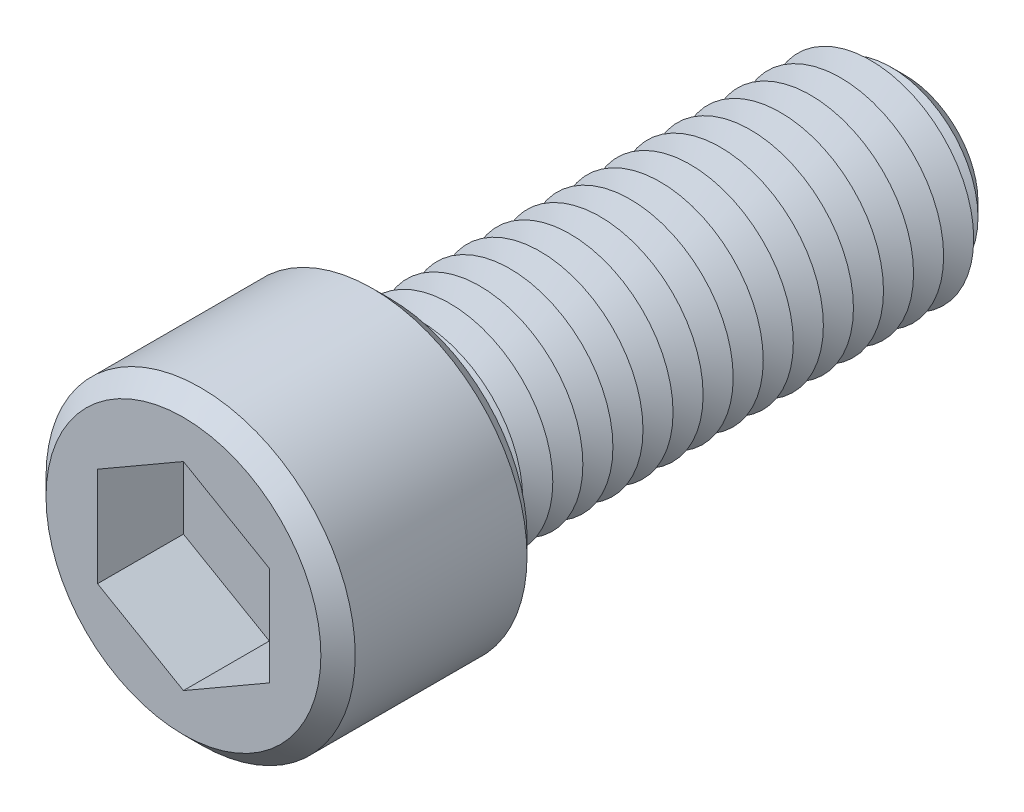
from build123d import *

# Parameters (mm, degrees)
SKETCH1_R           = 9
BOSS_EXTRUDE1_DEPTH = 12
SKETCH2_R           = 6
BOSS_EXTRUDE2_DEPTH = 30
CHAMFER1_SIZE       = 1.75
LPATTERN1_COUNT     = 17
LPATTERN1_PITCH     = 1.75
CUT_EXTRUDE1_DEPTH  = 5
SKETCH6_R           = 0.9
CUT_EXTRUDE2_DEPTH  = 37
CHAMFER2_SIZE       = 1


with BuildPart() as part:
    # Sketch1 → Boss-Extrude1 (new body)
    with BuildSketch(Plane.XY):
        Circle(SKETCH1_R)
    extrude(amount=BOSS_EXTRUDE1_DEPTH)

    # Sketch2 → Boss-Extrude2 (add)
    with BuildSketch(Plane(origin=(0, 0, 0), x_dir=(-1, 0, 0), z_dir=(0, 0, -1))):
        Circle(SKETCH2_R)
    extrude(amount=BOSS_EXTRUDE2_DEPTH)

    # Chamfer1
    chamfer1_edges = [part.edges().sort_by_distance(p)[0] for p in [
        (6, 0, -30),
    ]]
    chamfer(chamfer1_edges, length=CHAMFER1_SIZE)

    # Sketch4 → Cut-Revolve1 (revolve, cut)
    with BuildSketch(Plane(origin=(0, 0, 0), x_dir=(0, 0, -1), z_dir=(1, 0, 0)), mode=Mode.PRIVATE) as cut_revolve1_sk:
        Polygon((0, 6), (0.875, 4.484455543), (1.75, 6), align=None)
    cut_revolve1 = revolve(cut_revolve1_sk.sketch.rotate(Axis((0, 0, 2.512122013), (0, 0, -1)), 90), axis=Axis((0, 0, 2.512122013), (0, 0, -1)), mode=Mode.SUBTRACT)

    # LPattern1: Cut-Revolve1 ×17
    with Locations(*[(0, 0, -i * LPATTERN1_PITCH) for i in range(1, LPATTERN1_COUNT)]):
        add(cut_revolve1, mode=Mode.SUBTRACT)

    # Sketch5 → Cut-Extrude1 (cut)
    with BuildSketch(Plane.XY.offset(12)):
        Polygon((0, 5.773502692), (-5, 2.886751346), (-5, -2.886751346), (0, -5.773502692), (5, -2.886751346), (5, 2.886751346), align=None)
    extrude(amount=-CUT_EXTRUDE1_DEPTH, mode=Mode.SUBTRACT)

    # Sketch6 → Cut-Extrude2 (cut)
    with BuildSketch(Plane.XY.offset(7)):
        Circle(SKETCH6_R)
    extrude(amount=-CUT_EXTRUDE2_DEPTH, mode=Mode.SUBTRACT)

    # Chamfer2
    chamfer2_edges = [part.edges().sort_by_distance(p)[0] for p in [
        (-9, 0, 0),
        (-9, 0, 12),
    ]]
    chamfer(chamfer2_edges, length=CHAMFER2_SIZE)


solid = part.part
